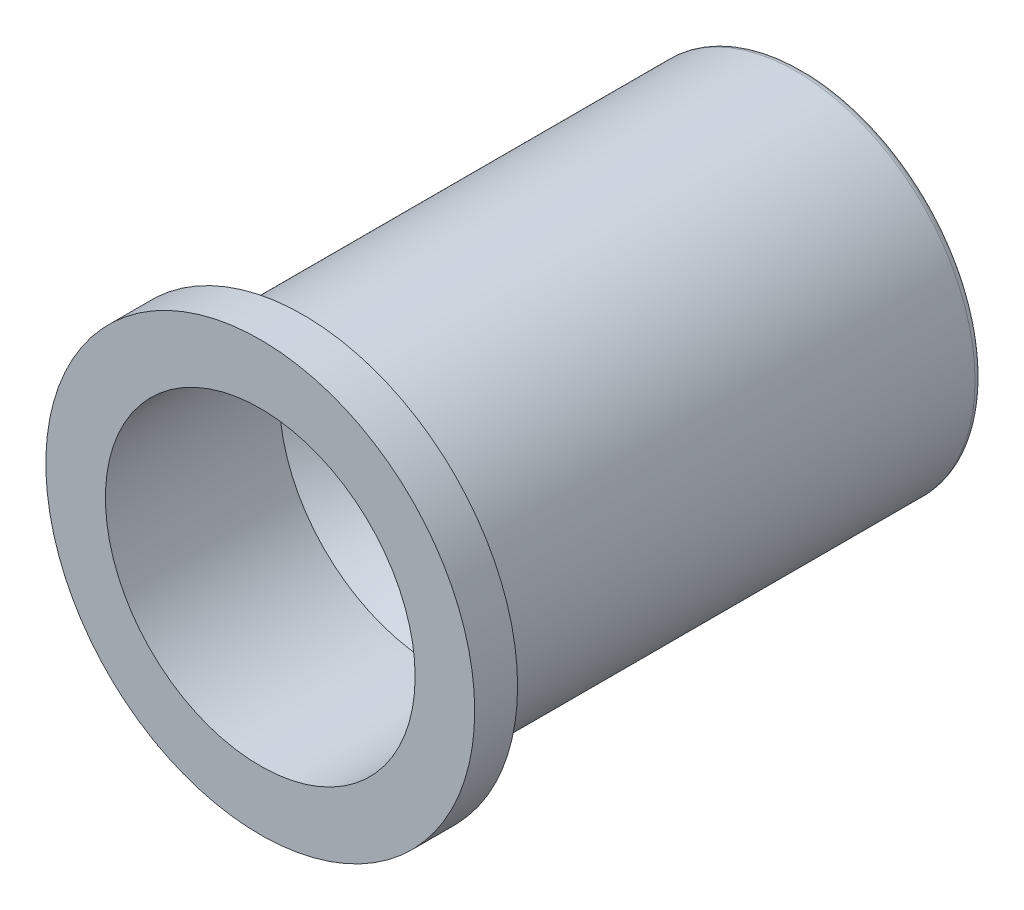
ISO-10303-21;
HEADER;
FILE_DESCRIPTION(('STEP AP214'),'2;1');
FILE_NAME('part.step','',(''),(''),'','','');
FILE_SCHEMA(('AUTOMOTIVE_DESIGN { 1 0 10303 214 1 1 1 1 }'));
ENDSEC;
DATA;
#1=APPLICATION_CONTEXT('core data for automotive mechanical design processes');
#2=APPLICATION_PROTOCOL_DEFINITION('international standard','automotive_design',2000,#1);
#3=PRODUCT_CONTEXT('',#1,'mechanical');
#4=PRODUCT('Part','Part','',(#3));
#5=PRODUCT_RELATED_PRODUCT_CATEGORY('part','',(#4));
#6=PRODUCT_DEFINITION_FORMATION('','',#4);
#7=PRODUCT_DEFINITION_CONTEXT('part definition',#1,'design');
#8=PRODUCT_DEFINITION('design','',#6,#7);
#9=PRODUCT_DEFINITION_SHAPE('','',#8);
#10=(LENGTH_UNIT() NAMED_UNIT(*) SI_UNIT(.MILLI.,.METRE.));
#11=(NAMED_UNIT(*) PLANE_ANGLE_UNIT() SI_UNIT($,.RADIAN.));
#12=(NAMED_UNIT(*) SI_UNIT($,.STERADIAN.) SOLID_ANGLE_UNIT());
#13=UNCERTAINTY_MEASURE_WITH_UNIT(LENGTH_MEASURE(1.E-05),#10,'distance_accuracy_value','');
#14=(GEOMETRIC_REPRESENTATION_CONTEXT(3) GLOBAL_UNCERTAINTY_ASSIGNED_CONTEXT((#13)) GLOBAL_UNIT_ASSIGNED_CONTEXT((#10,
#11,#12)) REPRESENTATION_CONTEXT('',''));
#15=CARTESIAN_POINT('',(0.,0.,0.));
#16=DIRECTION('',(0.,0.,1.));
#17=DIRECTION('',(1.,0.,0.));
#18=AXIS2_PLACEMENT_3D('',#15,#16,#17);
#19=CARTESIAN_POINT('',(0.,0.,-1.8));
#20=DIRECTION('',(0.,0.,1.));
#21=DIRECTION('',(1.,0.,0.));
#22=AXIS2_PLACEMENT_3D('',#19,#20,#21);
#23=PLANE('',#22);
#24=CARTESIAN_POINT('',(0.,0.,-1.8));
#25=DIRECTION('',(0.,0.,1.));
#26=DIRECTION('',(1.,0.,0.));
#27=AXIS2_PLACEMENT_3D('',#24,#25,#26);
#28=CIRCLE('',#27,7.8);
#29=CARTESIAN_POINT('',(7.8,0.,-1.8));
#30=VERTEX_POINT('',#29);
#31=EDGE_CURVE('E48',#30,#30,#28,.T.);
#32=ORIENTED_EDGE('',*,*,#31,.T.);
#33=EDGE_LOOP('',(#32));
#34=FACE_BOUND('',#33,.T.);
#35=CARTESIAN_POINT('',(0.,0.,-1.8));
#36=DIRECTION('',(0.,0.,1.));
#37=DIRECTION('',(1.,0.,0.));
#38=AXIS2_PLACEMENT_3D('',#35,#36,#37);
#39=CIRCLE('',#38,9.);
#40=CARTESIAN_POINT('',(9.,0.,-1.8));
#41=VERTEX_POINT('',#40);
#42=EDGE_CURVE('E62',#41,#41,#39,.T.);
#43=ORIENTED_EDGE('',*,*,#42,.F.);
#44=EDGE_LOOP('',(#43));
#45=FACE_BOUND('',#44,.T.);
#46=ADVANCED_FACE('F33',(#34,#45),#23,.F.);
#47=CARTESIAN_POINT('',(0.,0.,-1.8));
#48=DIRECTION('',(0.,0.,1.));
#49=DIRECTION('',(1.,0.,0.));
#50=AXIS2_PLACEMENT_3D('',#47,#48,#49);
#51=CYLINDRICAL_SURFACE('',#50,9.);
#52=ORIENTED_EDGE('',*,*,#42,.T.);
#53=EDGE_LOOP('',(#52));
#54=FACE_BOUND('',#53,.T.);
#55=CARTESIAN_POINT('',(0.,0.,0.));
#56=DIRECTION('',(0.,0.,1.));
#57=DIRECTION('',(1.,0.,0.));
#58=AXIS2_PLACEMENT_3D('',#55,#56,#57);
#59=CIRCLE('',#58,9.);
#60=CARTESIAN_POINT('',(9.,0.,0.));
#61=VERTEX_POINT('',#60);
#62=EDGE_CURVE('E63',#61,#61,#59,.T.);
#63=ORIENTED_EDGE('',*,*,#62,.F.);
#64=EDGE_LOOP('',(#63));
#65=FACE_BOUND('',#64,.T.);
#66=ADVANCED_FACE('F90',(#54,#65),#51,.T.);
#67=CARTESIAN_POINT('',(0.,0.,0.));
#68=DIRECTION('',(0.,0.,1.));
#69=DIRECTION('',(1.,0.,0.));
#70=AXIS2_PLACEMENT_3D('',#67,#68,#69);
#71=PLANE('',#70);
#72=CARTESIAN_POINT('',(0.,0.,-5.6843418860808E-11));
#73=DIRECTION('',(0.,0.,1.));
#74=DIRECTION('',(1.,0.,0.));
#75=AXIS2_PLACEMENT_3D('',#72,#73,#74);
#76=CIRCLE('',#75,6.5);
#77=CARTESIAN_POINT('',(6.5,0.,-5.6843418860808E-11));
#78=VERTEX_POINT('',#77);
#79=EDGE_CURVE('E69',#78,#78,#76,.T.);
#80=ORIENTED_EDGE('',*,*,#79,.F.);
#81=EDGE_LOOP('',(#80));
#82=FACE_BOUND('',#81,.T.);
#83=ORIENTED_EDGE('',*,*,#62,.T.);
#84=EDGE_LOOP('',(#83));
#85=FACE_BOUND('',#84,.T.);
#86=ADVANCED_FACE('F86',(#82,#85),#71,.T.);
#87=CARTESIAN_POINT('',(0.,0.,-22.7999999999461));
#88=DIRECTION('',(0.,0.,1.));
#89=DIRECTION('',(1.,0.,0.));
#90=AXIS2_PLACEMENT_3D('',#87,#88,#89);
#91=CYLINDRICAL_SURFACE('',#90,7.5);
#92=CARTESIAN_POINT('',(0.,0.,-22.4999999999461));
#93=DIRECTION('',(0.,0.,-1.));
#94=DIRECTION('',(-1.,0.,0.));
#95=AXIS2_PLACEMENT_3D('',#92,#93,#94);
#96=CIRCLE('',#95,7.5);
#97=CARTESIAN_POINT('',(7.5,0.,-22.4999999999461));
#98=VERTEX_POINT('',#97);
#99=EDGE_CURVE('E53',#98,#98,#96,.F.);
#100=CARTESIAN_POINT('',(0.,0.,-2.1));
#101=DIRECTION('',(0.,0.,1.));
#102=DIRECTION('',(1.,0.,0.));
#103=AXIS2_PLACEMENT_3D('',#100,#101,#102);
#104=CIRCLE('',#103,7.5);
#105=CARTESIAN_POINT('',(7.5,0.,-2.1));
#106=VERTEX_POINT('',#105);
#107=EDGE_CURVE('E56',#106,#106,#104,.F.);
#108=CARTESIAN_POINT('',(7.5,0.,-22.4999999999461));
#109=CARTESIAN_POINT('',(7.5,0.,-22.2874999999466));
#110=CARTESIAN_POINT('',(7.5,0.,-22.0749999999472));
#111=CARTESIAN_POINT('',(7.5,0.,-21.6499999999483));
#112=CARTESIAN_POINT('',(7.5,0.,-21.4374999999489));
#113=CARTESIAN_POINT('',(7.5,0.,-21.01249999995));
#114=CARTESIAN_POINT('',(7.5,0.,-20.7999999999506));
#115=CARTESIAN_POINT('',(7.5,0.,-20.3749999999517));
#116=CARTESIAN_POINT('',(7.5,0.,-20.1624999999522));
#117=CARTESIAN_POINT('',(7.5,0.,-19.7374999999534));
#118=CARTESIAN_POINT('',(7.5,0.,-19.5249999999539));
#119=CARTESIAN_POINT('',(7.5,0.,-19.0999999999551));
#120=CARTESIAN_POINT('',(7.5,0.,-18.8874999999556));
#121=CARTESIAN_POINT('',(7.5,0.,-18.4624999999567));
#122=CARTESIAN_POINT('',(7.5,0.,-18.2499999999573));
#123=CARTESIAN_POINT('',(7.5,0.,-17.8249999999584));
#124=CARTESIAN_POINT('',(7.5,0.,-17.612499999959));
#125=CARTESIAN_POINT('',(7.5,0.,-17.1874999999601));
#126=CARTESIAN_POINT('',(7.5,0.,-16.9749999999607));
#127=CARTESIAN_POINT('',(7.5,0.,-16.5499999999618));
#128=CARTESIAN_POINT('',(7.5,0.,-16.3374999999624));
#129=CARTESIAN_POINT('',(7.5,0.,-15.9124999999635));
#130=CARTESIAN_POINT('',(7.5,0.,-15.699999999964));
#131=CARTESIAN_POINT('',(7.5,0.,-15.2749999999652));
#132=CARTESIAN_POINT('',(7.5,0.,-15.0624999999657));
#133=CARTESIAN_POINT('',(7.5,0.,-14.6374999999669));
#134=CARTESIAN_POINT('',(7.5,0.,-14.4249999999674));
#135=CARTESIAN_POINT('',(7.5,0.,-13.9999999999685));
#136=CARTESIAN_POINT('',(7.5,0.,-13.7874999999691));
#137=CARTESIAN_POINT('',(7.5,0.,-13.3624999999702));
#138=CARTESIAN_POINT('',(7.5,0.,-13.1499999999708));
#139=CARTESIAN_POINT('',(7.5,0.,-12.7249999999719));
#140=CARTESIAN_POINT('',(7.5,0.,-12.5124999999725));
#141=CARTESIAN_POINT('',(7.5,0.,-12.0874999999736));
#142=CARTESIAN_POINT('',(7.5,0.,-11.8749999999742));
#143=CARTESIAN_POINT('',(7.5,0.,-11.4499999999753));
#144=CARTESIAN_POINT('',(7.5,0.,-11.2374999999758));
#145=CARTESIAN_POINT('',(7.5,0.,-10.812499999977));
#146=CARTESIAN_POINT('',(7.5,0.,-10.5999999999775));
#147=CARTESIAN_POINT('',(7.5,0.,-10.1749999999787));
#148=CARTESIAN_POINT('',(7.5,0.,-9.96249999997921));
#149=CARTESIAN_POINT('',(7.5,0.,-9.53749999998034));
#150=CARTESIAN_POINT('',(7.5,0.,-9.3249999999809));
#151=CARTESIAN_POINT('',(7.5,0.,-8.89999999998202));
#152=CARTESIAN_POINT('',(7.5,0.,-8.68749999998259));
#153=CARTESIAN_POINT('',(7.5,0.,-8.26249999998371));
#154=CARTESIAN_POINT('',(7.5,0.,-8.04999999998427));
#155=CARTESIAN_POINT('',(7.5,0.,-7.62499999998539));
#156=CARTESIAN_POINT('',(7.5,0.,-7.41249999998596));
#157=CARTESIAN_POINT('',(7.5,0.,-6.98749999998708));
#158=CARTESIAN_POINT('',(7.5,0.,-6.77499999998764));
#159=CARTESIAN_POINT('',(7.5,0.,-6.34999999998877));
#160=CARTESIAN_POINT('',(7.5,0.,-6.13749999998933));
#161=CARTESIAN_POINT('',(7.5,0.,-5.71249999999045));
#162=CARTESIAN_POINT('',(7.5,0.,-5.49999999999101));
#163=CARTESIAN_POINT('',(7.5,0.,-5.07499999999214));
#164=CARTESIAN_POINT('',(7.5,0.,-4.8624999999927));
#165=CARTESIAN_POINT('',(7.5,0.,-4.43749999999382));
#166=CARTESIAN_POINT('',(7.5,0.,-4.22499999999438));
#167=CARTESIAN_POINT('',(7.5,0.,-3.79999999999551));
#168=CARTESIAN_POINT('',(7.5,0.,-3.58749999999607));
#169=CARTESIAN_POINT('',(7.5,0.,-3.16249999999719));
#170=CARTESIAN_POINT('',(7.5,0.,-2.94999999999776));
#171=CARTESIAN_POINT('',(7.5,0.,-2.52499999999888));
#172=CARTESIAN_POINT('',(7.5,0.,-2.31249999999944));
#173=CARTESIAN_POINT('',(7.5,0.,-2.1));
#174=B_SPLINE_CURVE_WITH_KNOTS('',3,(#108,#109,#110,#111,#112,#113,#114,#115,#116,#117,#118,
#119,#120,#121,#122,#123,#124,#125,#126,#127,#128,#129,#130,#131,#132,#133,#134,#135,#136,#137,
#138,#139,#140,#141,#142,#143,#144,#145,#146,#147,#148,#149,#150,#151,#152,#153,#154,#155,#156,
#157,#158,#159,#160,#161,#162,#163,#164,#165,#166,#167,#168,#169,#170,#171,#172,#173),
.UNSPECIFIED.,.F.,.F.,(4,2,2,2,2,2,2,2,2,2,2,2,2,2,2,2,2,2,2,2,2,2,2,2,2,2,2,2,2,2,2,2,4),(0.,
0.637499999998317,1.27499999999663,1.91249999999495,2.54999999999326,3.18749999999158,
3.82499999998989,4.4624999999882,5.09999999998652,5.73749999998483,6.37499999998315,
7.01249999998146,7.64999999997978,8.28749999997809,8.9249999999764,9.56249999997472,
10.199999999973,10.8374999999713,11.4749999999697,12.112499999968,12.7499999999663,
13.3874999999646,14.0249999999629,14.6624999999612,15.2999999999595,15.9374999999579,
16.5749999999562,17.2124999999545,17.8499999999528,18.4874999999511,19.1249999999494,
19.7624999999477,20.3999999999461),.UNSPECIFIED.);
#175=EDGE_CURVE('BSEAM89',#98,#106,#174,.T.);
#176=ORIENTED_EDGE('',*,*,#99,.T.);
#177=ORIENTED_EDGE('',*,*,#107,.T.);
#178=ORIENTED_EDGE('',*,*,#175,.T.);
#179=ORIENTED_EDGE('',*,*,#175,.F.);
#180=EDGE_LOOP('',(#176,#178,#177,#179));
#181=FACE_BOUND('',#180,.T.);
#182=ADVANCED_FACE('F89',(#181),#91,.T.);
#183=CARTESIAN_POINT('',(0.,0.,-22.7999999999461));
#184=DIRECTION('',(0.,0.,-1.));
#185=DIRECTION('',(-1.,0.,0.));
#186=AXIS2_PLACEMENT_3D('',#183,#184,#185);
#187=PLANE('',#186);
#188=CARTESIAN_POINT('',(0.,0.,-22.7999999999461));
#189=DIRECTION('',(0.,0.,-1.));
#190=DIRECTION('',(-1.,0.,0.));
#191=AXIS2_PLACEMENT_3D('',#188,#189,#190);
#192=CIRCLE('',#191,5.49999999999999);
#193=CARTESIAN_POINT('',(-5.49999999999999,0.,-22.7999999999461));
#194=VERTEX_POINT('',#193);
#195=EDGE_CURVE('E40',#194,#194,#192,.F.);
#196=ORIENTED_EDGE('',*,*,#195,.T.);
#197=EDGE_LOOP('',(#196));
#198=FACE_BOUND('',#197,.T.);
#199=CARTESIAN_POINT('',(0.,0.,-22.7999999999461));
#200=DIRECTION('',(0.,0.,-1.));
#201=DIRECTION('',(-1.,0.,0.));
#202=AXIS2_PLACEMENT_3D('',#199,#200,#201);
#203=CIRCLE('',#202,7.2);
#204=CARTESIAN_POINT('',(-7.2,0.,-22.7999999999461));
#205=VERTEX_POINT('',#204);
#206=EDGE_CURVE('E59',#205,#205,#203,.T.);
#207=ORIENTED_EDGE('',*,*,#206,.T.);
#208=EDGE_LOOP('',(#207));
#209=FACE_BOUND('',#208,.T.);
#210=ADVANCED_FACE('F82',(#198,#209),#187,.T.);
#211=CARTESIAN_POINT('',(0.,0.,-7.30000000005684));
#212=DIRECTION('',(0.,0.,1.));
#213=DIRECTION('',(1.,0.,0.));
#214=AXIS2_PLACEMENT_3D('',#211,#212,#213);
#215=CYLINDRICAL_SURFACE('',#214,6.5);
#216=CARTESIAN_POINT('',(0.,0.,-7.30000000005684));
#217=DIRECTION('',(0.,0.,1.));
#218=DIRECTION('',(1.,0.,0.));
#219=AXIS2_PLACEMENT_3D('',#216,#217,#218);
#220=CIRCLE('',#219,6.5);
#221=CARTESIAN_POINT('',(6.5,0.,-7.30000000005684));
#222=VERTEX_POINT('',#221);
#223=EDGE_CURVE('E66',#222,#222,#220,.T.);
#224=ORIENTED_EDGE('',*,*,#223,.F.);
#225=EDGE_LOOP('',(#224));
#226=FACE_BOUND('',#225,.T.);
#227=ORIENTED_EDGE('',*,*,#79,.T.);
#228=EDGE_LOOP('',(#227));
#229=FACE_BOUND('',#228,.T.);
#230=ADVANCED_FACE('F78',(#226,#229),#215,.F.);
#231=CARTESIAN_POINT('',(0.,0.,-22.7999999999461));
#232=DIRECTION('',(0.,0.,1.));
#233=DIRECTION('',(1.,0.,0.));
#234=AXIS2_PLACEMENT_3D('',#231,#232,#233);
#235=CYLINDRICAL_SURFACE('',#234,5.);
#236=CARTESIAN_POINT('',(0.,0.,-22.2999999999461));
#237=DIRECTION('',(0.,0.,-1.));
#238=DIRECTION('',(-1.,0.,0.));
#239=AXIS2_PLACEMENT_3D('',#236,#237,#238);
#240=CIRCLE('',#239,5.);
#241=CARTESIAN_POINT('',(-5.,0.,-22.2999999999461));
#242=VERTEX_POINT('',#241);
#243=EDGE_CURVE('E10',#242,#242,#240,.T.);
#244=ORIENTED_EDGE('',*,*,#243,.T.);
#245=EDGE_LOOP('',(#244));
#246=FACE_BOUND('',#245,.T.);
#247=CARTESIAN_POINT('',(0.,0.,-8.80000000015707));
#248=DIRECTION('',(0.,0.,1.));
#249=DIRECTION('',(1.,0.,0.));
#250=AXIS2_PLACEMENT_3D('',#247,#248,#249);
#251=CIRCLE('',#250,5.);
#252=CARTESIAN_POINT('',(5.,0.,-8.80000000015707));
#253=VERTEX_POINT('',#252);
#254=EDGE_CURVE('E44',#253,#253,#251,.T.);
#255=ORIENTED_EDGE('',*,*,#254,.T.);
#256=EDGE_LOOP('',(#255));
#257=FACE_BOUND('',#256,.T.);
#258=ADVANCED_FACE('F81',(#246,#257),#235,.F.);
#259=CARTESIAN_POINT('',(0.,0.,-22.4999999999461));
#260=DIRECTION('',(0.,0.,-1.));
#261=DIRECTION('',(-1.,0.,0.));
#262=AXIS2_PLACEMENT_3D('',#259,#260,#261);
#263=TOROIDAL_SURFACE('',#262,7.2,0.3);
#264=ORIENTED_EDGE('',*,*,#99,.F.);
#265=EDGE_LOOP('',(#264));
#266=FACE_BOUND('',#265,.T.);
#267=ORIENTED_EDGE('',*,*,#206,.F.);
#268=EDGE_LOOP('',(#267));
#269=FACE_BOUND('',#268,.T.);
#270=ADVANCED_FACE('F103',(#266,#269),#263,.T.);
#271=CARTESIAN_POINT('',(0.,0.,-2.1));
#272=DIRECTION('',(0.,0.,1.));
#273=DIRECTION('',(1.,0.,0.));
#274=AXIS2_PLACEMENT_3D('',#271,#272,#273);
#275=TOROIDAL_SURFACE('',#274,7.8,0.3);
#276=ORIENTED_EDGE('',*,*,#31,.F.);
#277=EDGE_LOOP('',(#276));
#278=FACE_BOUND('',#277,.T.);
#279=ORIENTED_EDGE('',*,*,#107,.F.);
#280=EDGE_LOOP('',(#279));
#281=FACE_BOUND('',#280,.T.);
#282=ADVANCED_FACE('F106',(#278,#281),#275,.F.);
#283=CARTESIAN_POINT('',(0.,0.,-8.80000000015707));
#284=DIRECTION('',(0.,0.,1.));
#285=DIRECTION('',(1.,0.,0.));
#286=AXIS2_PLACEMENT_3D('',#283,#284,#285);
#287=CONICAL_SURFACE('',#286,5.,0.785398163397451);
#288=ORIENTED_EDGE('',*,*,#223,.T.);
#289=EDGE_LOOP('',(#288));
#290=FACE_BOUND('',#289,.T.);
#291=ORIENTED_EDGE('',*,*,#254,.F.);
#292=EDGE_LOOP('',(#291));
#293=FACE_BOUND('',#292,.T.);
#294=ADVANCED_FACE('F75',(#290,#293),#287,.F.);
#295=CARTESIAN_POINT('',(0.,0.,-22.7999999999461));
#296=DIRECTION('',(0.,0.,-1.));
#297=DIRECTION('',(-1.,0.,0.));
#298=AXIS2_PLACEMENT_3D('',#295,#296,#297);
#299=CONICAL_SURFACE('',#298,5.49999999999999,0.785398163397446);
#300=ORIENTED_EDGE('',*,*,#243,.F.);
#301=EDGE_LOOP('',(#300));
#302=FACE_BOUND('',#301,.T.);
#303=ORIENTED_EDGE('',*,*,#195,.F.);
#304=EDGE_LOOP('',(#303));
#305=FACE_BOUND('',#304,.T.);
#306=ADVANCED_FACE('F35',(#302,#305),#299,.F.);
#307=CLOSED_SHELL('',(#46,#66,#86,#182,#210,#230,#258,#270,#282,#294,#306));
#308=MANIFOLD_SOLID_BREP('B2',#307);
#309=ADVANCED_BREP_SHAPE_REPRESENTATION('',(#18,#308),#14);
#310=SHAPE_DEFINITION_REPRESENTATION(#9,#309);
ENDSEC;
END-ISO-10303-21;
